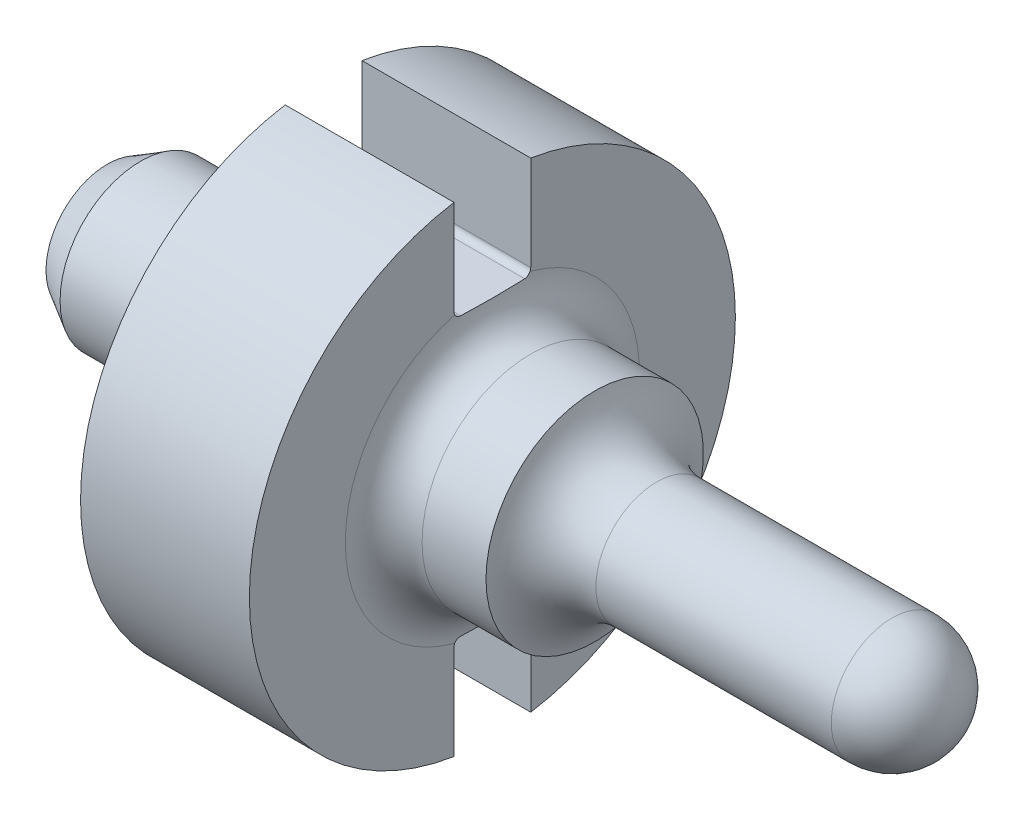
ISO-10303-21;
HEADER;
FILE_DESCRIPTION(('STEP AP214'),'2;1');
FILE_NAME('part.step','',(''),(''),'','','');
FILE_SCHEMA(('AUTOMOTIVE_DESIGN { 1 0 10303 214 1 1 1 1 }'));
ENDSEC;
DATA;
#1=APPLICATION_CONTEXT('core data for automotive mechanical design processes');
#2=APPLICATION_PROTOCOL_DEFINITION('international standard','automotive_design',2000,#1);
#3=PRODUCT_CONTEXT('',#1,'mechanical');
#4=PRODUCT('Part','Part','',(#3));
#5=PRODUCT_RELATED_PRODUCT_CATEGORY('part','',(#4));
#6=PRODUCT_DEFINITION_FORMATION('','',#4);
#7=PRODUCT_DEFINITION_CONTEXT('part definition',#1,'design');
#8=PRODUCT_DEFINITION('design','',#6,#7);
#9=PRODUCT_DEFINITION_SHAPE('','',#8);
#10=(LENGTH_UNIT() NAMED_UNIT(*) SI_UNIT(.MILLI.,.METRE.));
#11=(NAMED_UNIT(*) PLANE_ANGLE_UNIT() SI_UNIT($,.RADIAN.));
#12=(NAMED_UNIT(*) SI_UNIT($,.STERADIAN.) SOLID_ANGLE_UNIT());
#13=UNCERTAINTY_MEASURE_WITH_UNIT(LENGTH_MEASURE(1.E-05),#10,'distance_accuracy_value','');
#14=(GEOMETRIC_REPRESENTATION_CONTEXT(3) GLOBAL_UNCERTAINTY_ASSIGNED_CONTEXT((#13)) GLOBAL_UNIT_ASSIGNED_CONTEXT((#10,
#11,#12)) REPRESENTATION_CONTEXT('',''));
#15=CARTESIAN_POINT('',(0.,0.,0.));
#16=DIRECTION('',(0.,0.,1.));
#17=DIRECTION('',(1.,0.,0.));
#18=AXIS2_PLACEMENT_3D('',#15,#16,#17);
#19=CARTESIAN_POINT('',(0.,0.,0.));
#20=DIRECTION('',(-1.,0.,0.));
#21=DIRECTION('',(0.,0.,1.));
#22=AXIS2_PLACEMENT_3D('',#19,#20,#21);
#23=CYLINDRICAL_SURFACE('',#22,4.826);
#24=CARTESIAN_POINT('',(7.6454,0.,0.));
#25=DIRECTION('',(-1.,0.,0.));
#26=DIRECTION('',(0.,0.,1.));
#27=AXIS2_PLACEMENT_3D('',#24,#25,#26);
#28=CIRCLE('',#27,4.826);
#29=CARTESIAN_POINT('',(7.6454,-4.7654624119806,0.762));
#30=VERTEX_POINT('',#29);
#31=CARTESIAN_POINT('',(7.6454,4.7654624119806,0.762));
#32=VERTEX_POINT('',#31);
#33=EDGE_CURVE('E153',#30,#32,#28,.T.);
#34=ORIENTED_EDGE('',*,*,#33,.T.);
#35=DIRECTION('',(-1.,0.,0.));
#36=VECTOR('',#35,1.);
#37=CARTESIAN_POINT('',(0.,4.7654624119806,0.762));
#38=LINE('',#37,#36);
#39=CARTESIAN_POINT('',(4.2926,4.7654624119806,0.762));
#40=VERTEX_POINT('',#39);
#41=EDGE_CURVE('E136',#40,#32,#38,.F.);
#42=ORIENTED_EDGE('',*,*,#41,.F.);
#43=CARTESIAN_POINT('',(4.2926,0.,0.));
#44=DIRECTION('',(-1.,0.,0.));
#45=DIRECTION('',(0.,0.,1.));
#46=AXIS2_PLACEMENT_3D('',#43,#44,#45);
#47=CIRCLE('',#46,4.826);
#48=CARTESIAN_POINT('',(4.2926,-4.7654624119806,0.762));
#49=VERTEX_POINT('',#48);
#50=EDGE_CURVE('E151',#49,#40,#47,.T.);
#51=ORIENTED_EDGE('',*,*,#50,.F.);
#52=DIRECTION('',(-1.,0.,0.));
#53=VECTOR('',#52,1.);
#54=CARTESIAN_POINT('',(0.,-4.7654624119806,0.762));
#55=LINE('',#54,#53);
#56=EDGE_CURVE('E304',#30,#49,#55,.T.);
#57=ORIENTED_EDGE('',*,*,#56,.F.);
#58=EDGE_LOOP('',(#34,#42,#51,#57));
#59=FACE_BOUND('',#58,.T.);
#60=ADVANCED_FACE('F33',(#59),#23,.T.);
#61=CARTESIAN_POINT('',(7.6454,4.826,0.));
#62=DIRECTION('',(-1.,0.,0.));
#63=DIRECTION('',(0.,0.,1.));
#64=AXIS2_PLACEMENT_3D('',#61,#62,#63);
#65=PLANE('',#64);
#66=CARTESIAN_POINT('',(7.6454,2.8829,0.635));
#67=DIRECTION('',(-1.,0.,0.));
#68=DIRECTION('',(0.,0.,1.));
#69=AXIS2_PLACEMENT_3D('',#66,#67,#68);
#70=CIRCLE('',#69,0.127);
#71=CARTESIAN_POINT('',(7.6454,2.8829,0.762));
#72=VERTEX_POINT('',#71);
#73=CARTESIAN_POINT('',(7.6454,2.82376450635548,0.747392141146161));
#74=VERTEX_POINT('',#73);
#75=EDGE_CURVE('E380',#72,#74,#70,.F.);
#76=ORIENTED_EDGE('',*,*,#75,.F.);
#77=DIRECTION('',(0.,-1.,0.));
#78=VECTOR('',#77,1.);
#79=CARTESIAN_POINT('',(7.6454,2.8829,0.762));
#80=LINE('',#79,#78);
#81=EDGE_CURVE('E352',#32,#72,#80,.T.);
#82=ORIENTED_EDGE('',*,*,#81,.F.);
#83=ORIENTED_EDGE('',*,*,#33,.F.);
#84=DIRECTION('',(0.,-1.,0.));
#85=VECTOR('',#84,1.);
#86=CARTESIAN_POINT('',(7.6454,-2.8829,0.762));
#87=LINE('',#86,#85);
#88=CARTESIAN_POINT('',(7.6454,-2.8829,0.762));
#89=VERTEX_POINT('',#88);
#90=EDGE_CURVE('E257',#89,#30,#87,.T.);
#91=ORIENTED_EDGE('',*,*,#90,.F.);
#92=CARTESIAN_POINT('',(7.6454,-2.8829,0.635));
#93=DIRECTION('',(-1.,0.,0.));
#94=DIRECTION('',(0.,0.,1.));
#95=AXIS2_PLACEMENT_3D('',#92,#93,#94);
#96=CIRCLE('',#95,0.127);
#97=CARTESIAN_POINT('',(7.6454,-2.82376450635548,0.747392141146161));
#98=VERTEX_POINT('',#97);
#99=EDGE_CURVE('E302',#98,#89,#96,.F.);
#100=ORIENTED_EDGE('',*,*,#99,.F.);
#101=CARTESIAN_POINT('',(7.6454,0.,0.));
#102=DIRECTION('',(-1.,0.,0.));
#103=DIRECTION('',(0.,0.,1.));
#104=AXIS2_PLACEMENT_3D('',#101,#102,#103);
#105=CIRCLE('',#104,2.92100000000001);
#106=EDGE_CURVE('E317',#98,#74,#105,.T.);
#107=ORIENTED_EDGE('',*,*,#106,.T.);
#108=EDGE_LOOP('',(#76,#82,#83,#91,#100,#107));
#109=FACE_BOUND('',#108,.T.);
#110=ADVANCED_FACE('F203',(#109),#65,.F.);
#111=CARTESIAN_POINT('',(0.,0.,0.));
#112=DIRECTION('',(1.,0.,0.));
#113=DIRECTION('',(0.,0.,-1.));
#114=AXIS2_PLACEMENT_3D('',#111,#112,#113);
#115=PLANE('',#114);
#116=CARTESIAN_POINT('',(0.,0.,0.));
#117=DIRECTION('',(-1.,0.,0.));
#118=DIRECTION('',(0.,0.,1.));
#119=AXIS2_PLACEMENT_3D('',#116,#117,#118);
#120=CIRCLE('',#119,1.2192);
#121=CARTESIAN_POINT('',(0.,0.,1.2192));
#122=VERTEX_POINT('',#121);
#123=EDGE_CURVE('E11',#122,#122,#120,.T.);
#124=ORIENTED_EDGE('',*,*,#123,.T.);
#125=EDGE_LOOP('',(#124));
#126=FACE_BOUND('',#125,.T.);
#127=ADVANCED_FACE('F35',(#126),#115,.F.);
#128=CARTESIAN_POINT('',(0.659911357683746,0.,0.));
#129=DIRECTION('',(1.,0.,0.));
#130=DIRECTION('',(0.,0.,-1.));
#131=AXIS2_PLACEMENT_3D('',#128,#129,#130);
#132=CONICAL_SURFACE('',#131,1.6002,0.523598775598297);
#133=ORIENTED_EDGE('',*,*,#123,.F.);
#134=EDGE_LOOP('',(#133));
#135=FACE_BOUND('',#134,.T.);
#136=CARTESIAN_POINT('',(0.659911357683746,0.,0.));
#137=DIRECTION('',(-1.,0.,0.));
#138=DIRECTION('',(0.,0.,1.));
#139=AXIS2_PLACEMENT_3D('',#136,#137,#138);
#140=CIRCLE('',#139,1.6002);
#141=CARTESIAN_POINT('',(0.659911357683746,0.,1.6002));
#142=VERTEX_POINT('',#141);
#143=EDGE_CURVE('E41',#142,#142,#140,.T.);
#144=ORIENTED_EDGE('',*,*,#143,.T.);
#145=EDGE_LOOP('',(#144));
#146=FACE_BOUND('',#145,.T.);
#147=ADVANCED_FACE('F178',(#135,#146),#132,.T.);
#148=CARTESIAN_POINT('',(0.,0.,0.));
#149=DIRECTION('',(-1.,0.,0.));
#150=DIRECTION('',(0.,0.,1.));
#151=AXIS2_PLACEMENT_3D('',#148,#149,#150);
#152=CYLINDRICAL_SURFACE('',#151,1.6002);
#153=ORIENTED_EDGE('',*,*,#143,.F.);
#154=EDGE_LOOP('',(#153));
#155=FACE_BOUND('',#154,.T.);
#156=CARTESIAN_POINT('',(3.5306,0.,0.));
#157=DIRECTION('',(-1.,0.,0.));
#158=DIRECTION('',(0.,0.,1.));
#159=AXIS2_PLACEMENT_3D('',#156,#157,#158);
#160=CIRCLE('',#159,1.6002);
#161=CARTESIAN_POINT('',(3.5306,0.,1.6002));
#162=VERTEX_POINT('',#161);
#163=EDGE_CURVE('E173',#162,#162,#160,.T.);
#164=ORIENTED_EDGE('',*,*,#163,.T.);
#165=EDGE_LOOP('',(#164));
#166=FACE_BOUND('',#165,.T.);
#167=ADVANCED_FACE('F180',(#155,#166),#152,.T.);
#168=CARTESIAN_POINT('',(3.5306,0.,0.));
#169=DIRECTION('',(-1.,0.,0.));
#170=DIRECTION('',(0.,0.,1.));
#171=AXIS2_PLACEMENT_3D('',#168,#169,#170);
#172=TOROIDAL_SURFACE('',#171,2.3622,0.762);
#173=ORIENTED_EDGE('',*,*,#163,.F.);
#174=EDGE_LOOP('',(#173));
#175=FACE_BOUND('',#174,.T.);
#176=CARTESIAN_POINT('',(4.2926,0.,0.));
#177=DIRECTION('',(-1.,0.,0.));
#178=DIRECTION('',(0.,0.,1.));
#179=AXIS2_PLACEMENT_3D('',#176,#177,#178);
#180=CIRCLE('',#179,2.3622);
#181=CARTESIAN_POINT('',(4.2926,0.,2.3622));
#182=VERTEX_POINT('',#181);
#183=EDGE_CURVE('E166',#182,#182,#180,.T.);
#184=ORIENTED_EDGE('',*,*,#183,.T.);
#185=EDGE_LOOP('',(#184));
#186=FACE_BOUND('',#185,.T.);
#187=ADVANCED_FACE('F183',(#175,#186),#172,.F.);
#188=CARTESIAN_POINT('',(4.2926,2.36220000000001,0.));
#189=DIRECTION('',(1.,0.,0.));
#190=DIRECTION('',(0.,0.,-1.));
#191=AXIS2_PLACEMENT_3D('',#188,#189,#190);
#192=PLANE('',#191);
#193=ORIENTED_EDGE('',*,*,#183,.F.);
#194=EDGE_LOOP('',(#193));
#195=FACE_BOUND('',#194,.T.);
#196=ORIENTED_EDGE('',*,*,#50,.T.);
#197=DIRECTION('',(0.,1.,0.));
#198=VECTOR('',#197,1.);
#199=CARTESIAN_POINT('',(4.2926,2.8829,0.762));
#200=LINE('',#199,#198);
#201=CARTESIAN_POINT('',(4.2926,2.8829,0.762));
#202=VERTEX_POINT('',#201);
#203=EDGE_CURVE('E133',#202,#40,#200,.T.);
#204=ORIENTED_EDGE('',*,*,#203,.F.);
#205=CARTESIAN_POINT('',(4.2926,2.8829,0.635));
#206=DIRECTION('',(-1.,0.,0.));
#207=DIRECTION('',(0.,0.,1.));
#208=AXIS2_PLACEMENT_3D('',#205,#206,#207);
#209=CIRCLE('',#208,0.127);
#210=CARTESIAN_POINT('',(4.2926,2.7559,0.634999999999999));
#211=VERTEX_POINT('',#210);
#212=EDGE_CURVE('E546',#211,#202,#209,.T.);
#213=ORIENTED_EDGE('',*,*,#212,.F.);
#214=DIRECTION('',(0.,0.,1.));
#215=VECTOR('',#214,1.);
#216=CARTESIAN_POINT('',(4.2926,2.7559,-0.634999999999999));
#217=LINE('',#216,#215);
#218=CARTESIAN_POINT('',(4.2926,2.7559,-0.634999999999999));
#219=VERTEX_POINT('',#218);
#220=EDGE_CURVE('E542',#219,#211,#217,.T.);
#221=ORIENTED_EDGE('',*,*,#220,.F.);
#222=CARTESIAN_POINT('',(4.2926,2.8829,-0.635));
#223=DIRECTION('',(-1.,0.,0.));
#224=DIRECTION('',(0.,0.,-1.));
#225=AXIS2_PLACEMENT_3D('',#222,#223,#224);
#226=CIRCLE('',#225,0.127);
#227=CARTESIAN_POINT('',(4.2926,2.8829,-0.762));
#228=VERTEX_POINT('',#227);
#229=EDGE_CURVE('E390',#228,#219,#226,.T.);
#230=ORIENTED_EDGE('',*,*,#229,.F.);
#231=DIRECTION('',(0.,-1.,0.));
#232=VECTOR('',#231,1.);
#233=CARTESIAN_POINT('',(4.2926,2.8829,-0.762));
#234=LINE('',#233,#232);
#235=CARTESIAN_POINT('',(4.2926,4.7654624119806,-0.762));
#236=VERTEX_POINT('',#235);
#237=EDGE_CURVE('E144',#236,#228,#234,.T.);
#238=ORIENTED_EDGE('',*,*,#237,.F.);
#239=CARTESIAN_POINT('',(4.2926,-4.7654624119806,-0.762));
#240=VERTEX_POINT('',#239);
#241=EDGE_CURVE('E162',#236,#240,#47,.T.);
#242=ORIENTED_EDGE('',*,*,#241,.T.);
#243=DIRECTION('',(0.,-1.,0.));
#244=VECTOR('',#243,1.);
#245=CARTESIAN_POINT('',(4.2926,-2.8829,-0.762));
#246=LINE('',#245,#244);
#247=CARTESIAN_POINT('',(4.2926,-2.8829,-0.762));
#248=VERTEX_POINT('',#247);
#249=EDGE_CURVE('E283',#248,#240,#246,.T.);
#250=ORIENTED_EDGE('',*,*,#249,.F.);
#251=CARTESIAN_POINT('',(4.2926,-2.8829,-0.635));
#252=DIRECTION('',(-1.,0.,0.));
#253=DIRECTION('',(0.,0.,1.));
#254=AXIS2_PLACEMENT_3D('',#251,#252,#253);
#255=CIRCLE('',#254,0.127);
#256=CARTESIAN_POINT('',(4.2926,-2.7559,-0.634999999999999));
#257=VERTEX_POINT('',#256);
#258=EDGE_CURVE('E291',#257,#248,#255,.T.);
#259=ORIENTED_EDGE('',*,*,#258,.F.);
#260=DIRECTION('',(0.,0.,-1.));
#261=VECTOR('',#260,1.);
#262=CARTESIAN_POINT('',(4.2926,-2.7559,-0.634999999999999));
#263=LINE('',#262,#261);
#264=CARTESIAN_POINT('',(4.2926,-2.7559,0.634999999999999));
#265=VERTEX_POINT('',#264);
#266=EDGE_CURVE('E288',#265,#257,#263,.T.);
#267=ORIENTED_EDGE('',*,*,#266,.F.);
#268=CARTESIAN_POINT('',(4.2926,-2.8829,0.635));
#269=DIRECTION('',(-1.,0.,0.));
#270=DIRECTION('',(0.,0.,-1.));
#271=AXIS2_PLACEMENT_3D('',#268,#269,#270);
#272=CIRCLE('',#271,0.127);
#273=CARTESIAN_POINT('',(4.2926,-2.8829,0.762));
#274=VERTEX_POINT('',#273);
#275=EDGE_CURVE('E286',#274,#265,#272,.T.);
#276=ORIENTED_EDGE('',*,*,#275,.F.);
#277=DIRECTION('',(0.,1.,0.));
#278=VECTOR('',#277,1.);
#279=CARTESIAN_POINT('',(4.2926,-2.8829,0.762));
#280=LINE('',#279,#278);
#281=EDGE_CURVE('E161',#49,#274,#280,.T.);
#282=ORIENTED_EDGE('',*,*,#281,.F.);
#283=EDGE_LOOP('',(#196,#204,#213,#221,#230,#238,#242,#250,#259,#267,#276,#282));
#284=FACE_BOUND('',#283,.T.);
#285=ADVANCED_FACE('F158',(#195,#284),#192,.F.);
#286=ORIENTED_EDGE('',*,*,#241,.F.);
#287=DIRECTION('',(-1.,0.,0.));
#288=VECTOR('',#287,1.);
#289=CARTESIAN_POINT('',(0.,4.7654624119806,-0.762));
#290=LINE('',#289,#288);
#291=CARTESIAN_POINT('',(7.6454,4.7654624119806,-0.762));
#292=VERTEX_POINT('',#291);
#293=EDGE_CURVE('E155',#292,#236,#290,.T.);
#294=ORIENTED_EDGE('',*,*,#293,.F.);
#295=CARTESIAN_POINT('',(7.6454,-4.7654624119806,-0.762));
#296=VERTEX_POINT('',#295);
#297=EDGE_CURVE('E163',#292,#296,#28,.T.);
#298=ORIENTED_EDGE('',*,*,#297,.T.);
#299=DIRECTION('',(-1.,0.,0.));
#300=VECTOR('',#299,1.);
#301=CARTESIAN_POINT('',(0.,-4.7654624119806,-0.762));
#302=LINE('',#301,#300);
#303=EDGE_CURVE('E320',#240,#296,#302,.F.);
#304=ORIENTED_EDGE('',*,*,#303,.F.);
#305=EDGE_LOOP('',(#286,#294,#298,#304));
#306=FACE_BOUND('',#305,.T.);
#307=ADVANCED_FACE('F193',(#306),#23,.T.);
#308=DIRECTION('',(0.,1.,0.));
#309=VECTOR('',#308,1.);
#310=CARTESIAN_POINT('',(7.6454,2.8829,-0.762));
#311=LINE('',#310,#309);
#312=CARTESIAN_POINT('',(7.6454,2.8829,-0.762));
#313=VERTEX_POINT('',#312);
#314=EDGE_CURVE('E333',#313,#292,#311,.T.);
#315=ORIENTED_EDGE('',*,*,#314,.F.);
#316=CARTESIAN_POINT('',(7.6454,2.8829,-0.635));
#317=DIRECTION('',(-1.,0.,0.));
#318=DIRECTION('',(0.,0.,1.));
#319=AXIS2_PLACEMENT_3D('',#316,#317,#318);
#320=CIRCLE('',#319,0.127);
#321=CARTESIAN_POINT('',(7.6454,2.82376450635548,-0.747392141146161));
#322=VERTEX_POINT('',#321);
#323=EDGE_CURVE('E154',#322,#313,#320,.F.);
#324=ORIENTED_EDGE('',*,*,#323,.F.);
#325=CARTESIAN_POINT('',(7.6454,-2.82376450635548,-0.747392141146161));
#326=VERTEX_POINT('',#325);
#327=EDGE_CURVE('E374',#322,#326,#105,.T.);
#328=ORIENTED_EDGE('',*,*,#327,.T.);
#329=CARTESIAN_POINT('',(7.6454,-2.8829,-0.635));
#330=DIRECTION('',(-1.,0.,0.));
#331=DIRECTION('',(0.,0.,1.));
#332=AXIS2_PLACEMENT_3D('',#329,#330,#331);
#333=CIRCLE('',#332,0.127);
#334=CARTESIAN_POINT('',(7.6454,-2.8829,-0.762));
#335=VERTEX_POINT('',#334);
#336=EDGE_CURVE('E319',#335,#326,#333,.F.);
#337=ORIENTED_EDGE('',*,*,#336,.F.);
#338=DIRECTION('',(0.,1.,0.));
#339=VECTOR('',#338,1.);
#340=CARTESIAN_POINT('',(7.6454,-2.8829,-0.762));
#341=LINE('',#340,#339);
#342=EDGE_CURVE('E276',#296,#335,#341,.T.);
#343=ORIENTED_EDGE('',*,*,#342,.F.);
#344=ORIENTED_EDGE('',*,*,#297,.F.);
#345=EDGE_LOOP('',(#315,#324,#328,#337,#343,#344));
#346=FACE_BOUND('',#345,.T.);
#347=ADVANCED_FACE('F199',(#346),#65,.F.);
#348=CARTESIAN_POINT('',(8.4074,0.,0.));
#349=DIRECTION('',(-1.,0.,0.));
#350=DIRECTION('',(0.,0.,1.));
#351=AXIS2_PLACEMENT_3D('',#348,#349,#350);
#352=TOROIDAL_SURFACE('',#351,2.921,0.762);
#353=CARTESIAN_POINT('',(7.88389361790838,2.7559,2.11626178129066));
#354=CARTESIAN_POINT('',(7.86619216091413,2.7559,2.0887675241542));
#355=CARTESIAN_POINT('',(7.84985482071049,2.7559,2.06044551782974));
#356=CARTESIAN_POINT('',(7.81969906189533,2.7559,2.00256133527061));
#357=CARTESIAN_POINT('',(7.80587537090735,2.7559,1.97300191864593));
#358=CARTESIAN_POINT('',(7.76826995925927,2.7559,1.88411437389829));
#359=CARTESIAN_POINT('',(7.74766498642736,2.7559,1.82344461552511));
#360=CARTESIAN_POINT('',(7.70905721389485,2.7559,1.68482654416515));
#361=CARTESIAN_POINT('',(7.69300311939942,2.7559,1.60636095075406));
#362=CARTESIAN_POINT('',(7.66875230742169,2.7559,1.44819238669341));
#363=CARTESIAN_POINT('',(7.66056876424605,2.7559,1.36848756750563));
#364=CARTESIAN_POINT('',(7.64957261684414,2.7559,1.2074566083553));
#365=CARTESIAN_POINT('',(7.64684940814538,2.7559,1.12612516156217));
#366=CARTESIAN_POINT('',(7.64485892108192,2.7559,0.963487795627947));
#367=CARTESIAN_POINT('',(7.64559002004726,2.7559,0.882181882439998));
#368=CARTESIAN_POINT('',(7.64855422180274,2.7559,0.72410165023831));
#369=CARTESIAN_POINT('',(7.65070210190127,2.7559,0.647325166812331));
#370=CARTESIAN_POINT('',(7.655101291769,2.7559,0.493772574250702));
#371=CARTESIAN_POINT('',(7.65735260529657,2.7559,0.416996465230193));
#372=CARTESIAN_POINT('',(7.66097646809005,2.7559,0.263438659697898));
#373=CARTESIAN_POINT('',(7.66234922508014,2.7559,0.186656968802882));
#374=CARTESIAN_POINT('',(7.66368739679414,2.7559,0.0330855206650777));
#375=CARTESIAN_POINT('',(7.66365291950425,2.7559,-0.0437042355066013));
#376=CARTESIAN_POINT('',(7.66219235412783,2.7559,-0.197017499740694));
#377=CARTESIAN_POINT('',(7.66077081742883,2.7559,-0.273541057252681));
#378=CARTESIAN_POINT('',(7.65708902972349,2.7559,-0.426576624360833));
#379=CARTESIAN_POINT('',(7.6548286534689,2.7559,-0.503088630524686));
#380=CARTESIAN_POINT('',(7.65045647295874,2.7559,-0.656116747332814));
#381=CARTESIAN_POINT('',(7.64834466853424,2.7559,-0.732632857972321));
#382=CARTESIAN_POINT('',(7.64557952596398,2.7559,-0.885686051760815));
#383=CARTESIAN_POINT('',(7.64492586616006,2.7559,-0.962223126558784));
#384=CARTESIAN_POINT('',(7.6464173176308,2.7559,-1.09535113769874));
#385=CARTESIAN_POINT('',(7.64787803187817,2.7559,-1.15194685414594));
#386=CARTESIAN_POINT('',(7.65317151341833,2.7559,-1.26504173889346));
#387=CARTESIAN_POINT('',(7.65700449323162,2.7559,-1.32154089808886));
#388=CARTESIAN_POINT('',(7.66779460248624,2.7559,-1.43376621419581));
#389=CARTESIAN_POINT('',(7.67472434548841,2.7559,-1.48949482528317));
#390=CARTESIAN_POINT('',(7.69257045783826,2.7559,-1.60030286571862));
#391=CARTESIAN_POINT('',(7.7034859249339,2.7559,-1.65538243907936));
#392=CARTESIAN_POINT('',(7.73430041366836,2.7559,-1.7806290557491));
#393=CARTESIAN_POINT('',(7.75590556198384,2.7559,-1.8504125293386));
#394=CARTESIAN_POINT('',(7.79667767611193,2.7559,-1.95247821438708));
#395=CARTESIAN_POINT('',(7.8118379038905,2.7559,-1.98635784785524));
#396=CARTESIAN_POINT('',(7.84536755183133,2.7559,-2.05260107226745));
#397=CARTESIAN_POINT('',(7.8637459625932,2.7559,-2.08496008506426));
#398=CARTESIAN_POINT('',(7.88389361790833,2.7559,-2.11626178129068));
#399=B_SPLINE_CURVE_WITH_KNOTS('',3,(#353,#354,#355,#356,#357,#358,#359,#360,#361,#362,#363,
#364,#365,#366,#367,#368,#369,#370,#371,#372,#373,#374,#375,#376,#377,#378,#379,#380,#381,#382,
#383,#384,#385,#386,#387,#388,#389,#390,#391,#392,#393,#394,#395,#396,#397,#398),.UNSPECIFIED.,
.F.,.F.,(4,2,2,2,2,2,2,2,2,2,2,2,2,2,2,2,2,2,2,2,2,2,4),(0.,0.0979959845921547,
0.195783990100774,0.387428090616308,0.627136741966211,0.867245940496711,1.11125507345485,
1.35514959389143,1.58556813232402,1.81599504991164,2.04636746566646,2.27672220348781,
2.50632360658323,2.73595930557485,2.96559474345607,3.19517952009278,3.3649878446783,
3.5348113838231,3.70316191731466,3.8714743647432,4.08983315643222,4.20103251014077,
4.3125476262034),.UNSPECIFIED.);
#400=CARTESIAN_POINT('',(7.6510828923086,2.7559,0.634999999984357));
#401=VERTEX_POINT('',#400);
#402=CARTESIAN_POINT('',(7.65108289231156,2.75589999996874,-0.635000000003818));
#403=VERTEX_POINT('',#402);
#404=EDGE_CURVE('E346',#401,#403,#399,.T.);
#405=ORIENTED_EDGE('',*,*,#404,.F.);
#406=CARTESIAN_POINT('',(7.64785341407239,2.8831,0.761999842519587));
#407=CARTESIAN_POINT('',(7.64730191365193,2.87605276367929,0.762017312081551));
#408=CARTESIAN_POINT('',(7.64683725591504,2.86899858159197,0.761435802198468));
#409=CARTESIAN_POINT('',(7.64609536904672,2.85507948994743,0.75911415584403));
#410=CARTESIAN_POINT('',(7.64581798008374,2.84821442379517,0.757375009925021));
#411=CARTESIAN_POINT('',(7.64546326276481,2.8348593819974,0.752775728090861));
#412=CARTESIAN_POINT('',(7.64538607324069,2.82836966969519,0.749914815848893));
#413=CARTESIAN_POINT('',(7.64541802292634,2.81595778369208,0.743155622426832));
#414=CARTESIAN_POINT('',(7.64552712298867,2.81003549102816,0.739257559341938));
#415=CARTESIAN_POINT('',(7.64589822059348,2.79893152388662,0.73054087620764));
#416=CARTESIAN_POINT('',(7.64616000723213,2.79374884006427,0.725723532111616));
#417=CARTESIAN_POINT('',(7.64678690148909,2.78425521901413,0.715298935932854));
#418=CARTESIAN_POINT('',(7.64715203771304,2.77994452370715,0.709691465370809));
#419=CARTESIAN_POINT('',(7.64792985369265,2.77227532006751,0.697784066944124));
#420=CARTESIAN_POINT('',(7.64834296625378,2.76892660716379,0.691477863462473));
#421=CARTESIAN_POINT('',(7.64914917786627,2.76333211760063,0.678394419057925));
#422=CARTESIAN_POINT('',(7.6495422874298,2.76108575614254,0.67161743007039));
#423=CARTESIAN_POINT('',(7.65014519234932,2.75824522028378,0.65980996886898));
#424=CARTESIAN_POINT('',(7.6503749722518,2.75735995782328,0.65484854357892));
#425=CARTESIAN_POINT('',(7.65077799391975,2.75618330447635,0.644859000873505));
#426=CARTESIAN_POINT('',(7.65095129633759,2.75589127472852,0.639830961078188));
#427=CARTESIAN_POINT('',(7.65108838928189,2.75590015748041,0.634799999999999));
#428=B_SPLINE_CURVE_WITH_KNOTS('',3,(#406,#407,#408,#409,#410,#411,#412,#413,#414,#415,#416,
#417,#418,#419,#420,#421,#422,#423,#424,#425,#426,#427),.UNSPECIFIED.,.F.,.F.,(4,2,2,2,2,2,2,2,
2,2,4),(0.,0.0211799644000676,0.04234182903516,0.0635183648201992,0.0846904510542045,
0.105833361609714,0.12698212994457,0.148339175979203,0.169684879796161,0.184786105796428,
0.199871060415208),.UNSPECIFIED.);
#429=EDGE_CURVE('E145',#74,#401,#428,.T.);
#430=ORIENTED_EDGE('',*,*,#429,.F.);
#431=ORIENTED_EDGE('',*,*,#106,.F.);
#432=CARTESIAN_POINT('',(7.65108838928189,-2.75590015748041,0.634799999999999));
#433=CARTESIAN_POINT('',(7.65089549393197,-2.75588303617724,0.641946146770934));
#434=CARTESIAN_POINT('',(7.65062664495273,-2.75648044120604,0.649088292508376));
#435=CARTESIAN_POINT('',(7.64999019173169,-2.7588581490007,0.663161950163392));
#436=CARTESIAN_POINT('',(7.64962267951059,-2.76063735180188,0.67009365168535));
#437=CARTESIAN_POINT('',(7.64884138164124,-2.76533332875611,0.683559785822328));
#438=CARTESIAN_POINT('',(7.64842758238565,-2.76825043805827,0.690094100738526));
#439=CARTESIAN_POINT('',(7.64761869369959,-2.7751386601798,0.702581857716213));
#440=CARTESIAN_POINT('',(7.64722360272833,-2.7791096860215,0.708535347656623));
#441=CARTESIAN_POINT('',(7.64651480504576,-2.7880092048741,0.719710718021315));
#442=CARTESIAN_POINT('',(7.64620132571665,-2.79294030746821,0.724930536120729));
#443=CARTESIAN_POINT('',(7.64571388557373,-2.80361523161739,0.734469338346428));
#444=CARTESIAN_POINT('',(7.64553993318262,-2.80935910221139,0.73878826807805));
#445=CARTESIAN_POINT('',(7.64537389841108,-2.82144767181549,0.746369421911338));
#446=CARTESIAN_POINT('',(7.64538045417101,-2.82778751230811,0.749639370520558));
#447=CARTESIAN_POINT('',(7.64559335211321,-2.84092101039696,0.755071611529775));
#448=CARTESIAN_POINT('',(7.64579959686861,-2.84771444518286,0.757234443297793));
#449=CARTESIAN_POINT('',(7.64631085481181,-2.85930554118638,0.759881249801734));
#450=CARTESIAN_POINT('',(7.64656213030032,-2.86403579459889,0.760682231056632));
#451=CARTESIAN_POINT('',(7.64714749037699,-2.87354458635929,0.761745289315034));
#452=CARTESIAN_POINT('',(7.64748145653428,-2.87832304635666,0.762008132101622));
#453=CARTESIAN_POINT('',(7.64785341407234,-2.88309999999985,0.761999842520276));
#454=B_SPLINE_CURVE_WITH_KNOTS('',3,(#432,#433,#434,#435,#436,#437,#438,#439,#440,#441,#442,
#443,#444,#445,#446,#447,#448,#449,#450,#451,#452,#453),.UNSPECIFIED.,.F.,.F.,(4,2,2,2,2,2,2,2,
2,2,4),(0.,0.0214158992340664,0.0428118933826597,0.0642141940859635,0.0856147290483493,
0.107074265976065,0.128535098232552,0.149834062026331,0.171122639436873,0.185505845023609,
0.1998685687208),.UNSPECIFIED.);
#455=CARTESIAN_POINT('',(7.65108289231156,-2.75589999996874,0.635000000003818));
#456=VERTEX_POINT('',#455);
#457=EDGE_CURVE('E249',#456,#98,#454,.T.);
#458=ORIENTED_EDGE('',*,*,#457,.F.);
#459=CARTESIAN_POINT('',(7.88389361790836,-2.7559,-2.11626178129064));
#460=CARTESIAN_POINT('',(7.86619216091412,-2.7559,-2.08876752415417));
#461=CARTESIAN_POINT('',(7.84985482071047,-2.7559,-2.06044551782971));
#462=CARTESIAN_POINT('',(7.81969906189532,-2.7559,-2.00256133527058));
#463=CARTESIAN_POINT('',(7.80587537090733,-2.7559,-1.97300191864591));
#464=CARTESIAN_POINT('',(7.76826995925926,-2.7559,-1.88411437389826));
#465=CARTESIAN_POINT('',(7.74766498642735,-2.7559,-1.82344461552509));
#466=CARTESIAN_POINT('',(7.70905721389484,-2.7559,-1.68482654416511));
#467=CARTESIAN_POINT('',(7.69300311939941,-2.7559,-1.60636095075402));
#468=CARTESIAN_POINT('',(7.66875230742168,-2.7559,-1.44819238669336));
#469=CARTESIAN_POINT('',(7.66056876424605,-2.7559,-1.36848756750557));
#470=CARTESIAN_POINT('',(7.64957261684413,-2.7559,-1.20745660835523));
#471=CARTESIAN_POINT('',(7.64684940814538,-2.7559,-1.1261251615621));
#472=CARTESIAN_POINT('',(7.64485892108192,-2.7559,-0.963487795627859));
#473=CARTESIAN_POINT('',(7.64559002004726,-2.7559,-0.882181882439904));
#474=CARTESIAN_POINT('',(7.64855422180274,-2.7559,-0.724101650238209));
#475=CARTESIAN_POINT('',(7.65070210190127,-2.7559,-0.647325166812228));
#476=CARTESIAN_POINT('',(7.655101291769,-2.7559,-0.493772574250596));
#477=CARTESIAN_POINT('',(7.65735260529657,-2.7559,-0.416996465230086));
#478=CARTESIAN_POINT('',(7.66097646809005,-2.7559,-0.263438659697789));
#479=CARTESIAN_POINT('',(7.66234922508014,-2.7559,-0.186656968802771));
#480=CARTESIAN_POINT('',(7.66368739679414,-2.7559,-0.033085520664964));
#481=CARTESIAN_POINT('',(7.66365291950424,-2.7559,0.0437042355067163));
#482=CARTESIAN_POINT('',(7.66219235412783,-2.7559,0.197017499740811));
#483=CARTESIAN_POINT('',(7.66077081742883,-2.7559,0.2735410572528));
#484=CARTESIAN_POINT('',(7.65708902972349,-2.7559,0.426576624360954));
#485=CARTESIAN_POINT('',(7.65482865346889,-2.7559,0.50308863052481));
#486=CARTESIAN_POINT('',(7.65045647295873,-2.7559,0.65611674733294));
#487=CARTESIAN_POINT('',(7.64834466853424,-2.7559,0.732632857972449));
#488=CARTESIAN_POINT('',(7.64557952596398,-2.7559,0.885686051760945));
#489=CARTESIAN_POINT('',(7.64492586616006,-2.7559,0.962223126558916));
#490=CARTESIAN_POINT('',(7.6464173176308,-2.7559,1.09535113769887));
#491=CARTESIAN_POINT('',(7.64787803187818,-2.7559,1.15194685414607));
#492=CARTESIAN_POINT('',(7.65317151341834,-2.7559,1.26504173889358));
#493=CARTESIAN_POINT('',(7.65700449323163,-2.7559,1.32154089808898));
#494=CARTESIAN_POINT('',(7.66779460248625,-2.7559,1.43376621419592));
#495=CARTESIAN_POINT('',(7.67472434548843,-2.7559,1.48949482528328));
#496=CARTESIAN_POINT('',(7.69257045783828,-2.7559,1.60030286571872));
#497=CARTESIAN_POINT('',(7.70348592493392,-2.7559,1.65538243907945));
#498=CARTESIAN_POINT('',(7.73430041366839,-2.7559,1.78062905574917));
#499=CARTESIAN_POINT('',(7.75590556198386,-2.7559,1.85041252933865));
#500=CARTESIAN_POINT('',(7.79667767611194,-2.7559,1.9524782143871));
#501=CARTESIAN_POINT('',(7.81183790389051,-2.7559,1.98635784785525));
#502=CARTESIAN_POINT('',(7.84536755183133,-2.7559,2.05260107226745));
#503=CARTESIAN_POINT('',(7.86374596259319,-2.7559,2.08496008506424));
#504=CARTESIAN_POINT('',(7.88389361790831,-2.7559,2.11626178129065));
#505=B_SPLINE_CURVE_WITH_KNOTS('',3,(#459,#460,#461,#462,#463,#464,#465,#466,#467,#468,#469,
#470,#471,#472,#473,#474,#475,#476,#477,#478,#479,#480,#481,#482,#483,#484,#485,#486,#487,#488,
#489,#490,#491,#492,#493,#494,#495,#496,#497,#498,#499,#500,#501,#502,#503,#504),.UNSPECIFIED.,
.F.,.F.,(4,2,2,2,2,2,2,2,2,2,2,2,2,2,2,2,2,2,2,2,2,2,4),(0.,0.0979959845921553,
0.195783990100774,0.387428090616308,0.627136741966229,0.867245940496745,1.1112550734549,
1.3551495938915,1.58556813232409,1.81599504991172,2.04636746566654,2.2767222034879,
2.50632360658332,2.73595930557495,2.96559474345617,3.19517952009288,3.36498784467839,
3.53481138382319,3.70316191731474,3.87147436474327,4.08983315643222,4.20103251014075,
4.31254762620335),.UNSPECIFIED.);
#506=CARTESIAN_POINT('',(7.6510828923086,-2.7559,-0.634999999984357));
#507=VERTEX_POINT('',#506);
#508=EDGE_CURVE('E269',#507,#456,#505,.T.);
#509=ORIENTED_EDGE('',*,*,#508,.F.);
#510=CARTESIAN_POINT('',(7.64785341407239,-2.8831,-0.761999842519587));
#511=CARTESIAN_POINT('',(7.64730191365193,-2.87605276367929,-0.762017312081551));
#512=CARTESIAN_POINT('',(7.64683725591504,-2.86899858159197,-0.761435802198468));
#513=CARTESIAN_POINT('',(7.64609536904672,-2.85507948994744,-0.75911415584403));
#514=CARTESIAN_POINT('',(7.64581798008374,-2.84821442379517,-0.757375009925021));
#515=CARTESIAN_POINT('',(7.64546326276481,-2.8348593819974,-0.752775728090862));
#516=CARTESIAN_POINT('',(7.64538607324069,-2.82836966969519,-0.749914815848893));
#517=CARTESIAN_POINT('',(7.64541802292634,-2.81595778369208,-0.743155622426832));
#518=CARTESIAN_POINT('',(7.64552712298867,-2.81003549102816,-0.739257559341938));
#519=CARTESIAN_POINT('',(7.64589822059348,-2.79893152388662,-0.73054087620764));
#520=CARTESIAN_POINT('',(7.64616000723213,-2.79374884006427,-0.725723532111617));
#521=CARTESIAN_POINT('',(7.64678690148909,-2.78425521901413,-0.715298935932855));
#522=CARTESIAN_POINT('',(7.64715203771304,-2.77994452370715,-0.70969146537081));
#523=CARTESIAN_POINT('',(7.64792985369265,-2.77227532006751,-0.697784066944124));
#524=CARTESIAN_POINT('',(7.64834296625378,-2.76892660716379,-0.691477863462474));
#525=CARTESIAN_POINT('',(7.64914917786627,-2.76333211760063,-0.678394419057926));
#526=CARTESIAN_POINT('',(7.6495422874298,-2.76108575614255,-0.67161743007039));
#527=CARTESIAN_POINT('',(7.65014519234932,-2.75824522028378,-0.659809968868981));
#528=CARTESIAN_POINT('',(7.6503749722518,-2.75735995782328,-0.654848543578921));
#529=CARTESIAN_POINT('',(7.65077799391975,-2.75618330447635,-0.644859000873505));
#530=CARTESIAN_POINT('',(7.65095129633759,-2.75589127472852,-0.639830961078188));
#531=CARTESIAN_POINT('',(7.65108838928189,-2.75590015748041,-0.634799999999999));
#532=B_SPLINE_CURVE_WITH_KNOTS('',3,(#510,#511,#512,#513,#514,#515,#516,#517,#518,#519,#520,
#521,#522,#523,#524,#525,#526,#527,#528,#529,#530,#531),.UNSPECIFIED.,.F.,.F.,(4,2,2,2,2,2,2,2,
2,2,4),(0.,0.0211799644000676,0.04234182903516,0.0635183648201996,0.0846904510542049,
0.105833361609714,0.12698212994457,0.148339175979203,0.169684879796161,0.184786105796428,
0.199871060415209),.UNSPECIFIED.);
#533=EDGE_CURVE('E275',#326,#507,#532,.T.);
#534=ORIENTED_EDGE('',*,*,#533,.F.);
#535=ORIENTED_EDGE('',*,*,#327,.F.);
#536=CARTESIAN_POINT('',(7.65108838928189,2.75590015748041,-0.634799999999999));
#537=CARTESIAN_POINT('',(7.65089549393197,2.75588303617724,-0.641946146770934));
#538=CARTESIAN_POINT('',(7.65062664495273,2.75648044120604,-0.649088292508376));
#539=CARTESIAN_POINT('',(7.64999019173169,2.7588581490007,-0.663161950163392));
#540=CARTESIAN_POINT('',(7.64962267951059,2.76063735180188,-0.67009365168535));
#541=CARTESIAN_POINT('',(7.64884138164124,2.76533332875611,-0.683559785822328));
#542=CARTESIAN_POINT('',(7.64842758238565,2.76825043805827,-0.690094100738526));
#543=CARTESIAN_POINT('',(7.64761869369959,2.7751386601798,-0.702581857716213));
#544=CARTESIAN_POINT('',(7.64722360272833,2.7791096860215,-0.708535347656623));
#545=CARTESIAN_POINT('',(7.64651480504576,2.7880092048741,-0.719710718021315));
#546=CARTESIAN_POINT('',(7.64620132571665,2.79294030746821,-0.724930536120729));
#547=CARTESIAN_POINT('',(7.64571388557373,2.80361523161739,-0.734469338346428));
#548=CARTESIAN_POINT('',(7.64553993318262,2.80935910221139,-0.73878826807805));
#549=CARTESIAN_POINT('',(7.64537389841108,2.82144767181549,-0.746369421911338));
#550=CARTESIAN_POINT('',(7.64538045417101,2.82778751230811,-0.749639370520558));
#551=CARTESIAN_POINT('',(7.64559335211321,2.84092101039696,-0.755071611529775));
#552=CARTESIAN_POINT('',(7.64579959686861,2.84771444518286,-0.757234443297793));
#553=CARTESIAN_POINT('',(7.64631085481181,2.85930554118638,-0.759881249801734));
#554=CARTESIAN_POINT('',(7.64656213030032,2.86403579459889,-0.760682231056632));
#555=CARTESIAN_POINT('',(7.64714749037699,2.87354458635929,-0.761745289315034));
#556=CARTESIAN_POINT('',(7.64748145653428,2.87832304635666,-0.762008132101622));
#557=CARTESIAN_POINT('',(7.64785341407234,2.88309999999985,-0.761999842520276));
#558=B_SPLINE_CURVE_WITH_KNOTS('',3,(#536,#537,#538,#539,#540,#541,#542,#543,#544,#545,#546,
#547,#548,#549,#550,#551,#552,#553,#554,#555,#556,#557),.UNSPECIFIED.,.F.,.F.,(4,2,2,2,2,2,2,2,
2,2,4),(0.,0.0214158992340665,0.0428118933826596,0.0642141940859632,0.0856147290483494,
0.107074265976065,0.128535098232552,0.149834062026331,0.171122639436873,0.185505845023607,
0.199868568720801),.UNSPECIFIED.);
#559=EDGE_CURVE('E325',#403,#322,#558,.T.);
#560=ORIENTED_EDGE('',*,*,#559,.F.);
#561=EDGE_LOOP('',(#405,#430,#431,#458,#509,#534,#535,#560));
#562=FACE_BOUND('',#561,.T.);
#563=CARTESIAN_POINT('',(8.40740000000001,0.,0.));
#564=DIRECTION('',(-1.,0.,0.));
#565=DIRECTION('',(0.,0.,1.));
#566=AXIS2_PLACEMENT_3D('',#563,#564,#565);
#567=CIRCLE('',#566,2.159);
#568=CARTESIAN_POINT('',(8.40740000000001,0.,2.159));
#569=VERTEX_POINT('',#568);
#570=EDGE_CURVE('E551',#569,#569,#567,.T.);
#571=ORIENTED_EDGE('',*,*,#570,.T.);
#572=EDGE_LOOP('',(#571));
#573=FACE_BOUND('',#572,.T.);
#574=ADVANCED_FACE('F211',(#562,#573),#352,.F.);
#575=CARTESIAN_POINT('',(0.,0.,0.));
#576=DIRECTION('',(-1.,0.,0.));
#577=DIRECTION('',(0.,0.,1.));
#578=AXIS2_PLACEMENT_3D('',#575,#576,#577);
#579=CYLINDRICAL_SURFACE('',#578,2.159);
#580=ORIENTED_EDGE('',*,*,#570,.F.);
#581=EDGE_LOOP('',(#580));
#582=FACE_BOUND('',#581,.T.);
#583=CARTESIAN_POINT('',(9.6774,0.,0.));
#584=DIRECTION('',(-1.,0.,0.));
#585=DIRECTION('',(0.,0.,1.));
#586=AXIS2_PLACEMENT_3D('',#583,#584,#585);
#587=CIRCLE('',#586,2.159);
#588=CARTESIAN_POINT('',(9.6774,0.,2.159));
#589=VERTEX_POINT('',#588);
#590=EDGE_CURVE('E555',#589,#589,#587,.T.);
#591=ORIENTED_EDGE('',*,*,#590,.T.);
#592=EDGE_LOOP('',(#591));
#593=FACE_BOUND('',#592,.T.);
#594=ADVANCED_FACE('F215',(#582,#593),#579,.T.);
#595=CARTESIAN_POINT('',(10.9070722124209,0.,0.));
#596=DIRECTION('',(-1.,0.,0.));
#597=DIRECTION('',(0.,0.,1.));
#598=AXIS2_PLACEMENT_3D('',#595,#596,#597);
#599=TOROIDAL_SURFACE('',#598,2.4765,1.27);
#600=ORIENTED_EDGE('',*,*,#590,.F.);
#601=EDGE_LOOP('',(#600));
#602=FACE_BOUND('',#601,.T.);
#603=CARTESIAN_POINT('',(10.9070722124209,0.,0.));
#604=DIRECTION('',(-1.,0.,0.));
#605=DIRECTION('',(0.,0.,1.));
#606=AXIS2_PLACEMENT_3D('',#603,#604,#605);
#607=CIRCLE('',#606,1.2065);
#608=CARTESIAN_POINT('',(10.9070722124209,0.,1.2065));
#609=VERTEX_POINT('',#608);
#610=EDGE_CURVE('E557',#609,#609,#607,.T.);
#611=ORIENTED_EDGE('',*,*,#610,.T.);
#612=EDGE_LOOP('',(#611));
#613=FACE_BOUND('',#612,.T.);
#614=ADVANCED_FACE('F219',(#602,#613),#599,.F.);
#615=CARTESIAN_POINT('',(0.,0.,0.));
#616=DIRECTION('',(-1.,0.,0.));
#617=DIRECTION('',(0.,0.,1.));
#618=AXIS2_PLACEMENT_3D('',#615,#616,#617);
#619=CYLINDRICAL_SURFACE('',#618,1.2065);
#620=ORIENTED_EDGE('',*,*,#610,.F.);
#621=EDGE_LOOP('',(#620));
#622=FACE_BOUND('',#621,.T.);
#623=CARTESIAN_POINT('',(15.5829,0.,0.));
#624=DIRECTION('',(-1.,0.,0.));
#625=DIRECTION('',(0.,0.,1.));
#626=AXIS2_PLACEMENT_3D('',#623,#624,#625);
#627=CIRCLE('',#626,1.2065);
#628=CARTESIAN_POINT('',(15.5829,0.,1.2065));
#629=VERTEX_POINT('',#628);
#630=EDGE_CURVE('E259',#629,#629,#627,.T.);
#631=ORIENTED_EDGE('',*,*,#630,.T.);
#632=EDGE_LOOP('',(#631));
#633=FACE_BOUND('',#632,.T.);
#634=ADVANCED_FACE('F223',(#622,#633),#619,.T.);
#635=CARTESIAN_POINT('',(15.5829,0.,0.));
#636=DIRECTION('',(-1.,0.,0.));
#637=DIRECTION('',(0.,1.,0.));
#638=AXIS2_PLACEMENT_3D('',#635,#636,#637);
#639=SPHERICAL_SURFACE('',#638,1.2065);
#640=ORIENTED_EDGE('',*,*,#630,.F.);
#641=EDGE_LOOP('',(#640));
#642=FACE_BOUND('',#641,.T.);
#643=ADVANCED_FACE('F227',(#642),#639,.T.);
#644=CARTESIAN_POINT('',(16.7904,-2.8829,-0.762));
#645=DIRECTION('',(0.,0.,-1.));
#646=DIRECTION('',(0.,1.,0.));
#647=AXIS2_PLACEMENT_3D('',#644,#645,#646);
#648=PLANE('',#647);
#649=ORIENTED_EDGE('',*,*,#303,.T.);
#650=ORIENTED_EDGE('',*,*,#342,.T.);
#651=DIRECTION('',(-1.,0.,0.));
#652=VECTOR('',#651,1.);
#653=CARTESIAN_POINT('',(16.7904,-2.8829,-0.762));
#654=LINE('',#653,#652);
#655=EDGE_CURVE('E295',#335,#248,#654,.T.);
#656=ORIENTED_EDGE('',*,*,#655,.T.);
#657=ORIENTED_EDGE('',*,*,#249,.T.);
#658=EDGE_LOOP('',(#649,#650,#656,#657));
#659=FACE_BOUND('',#658,.T.);
#660=ADVANCED_FACE('F231',(#659),#648,.F.);
#661=CARTESIAN_POINT('',(16.7904,-2.8829,-0.635));
#662=DIRECTION('',(-1.,0.,0.));
#663=DIRECTION('',(0.,0.,1.));
#664=AXIS2_PLACEMENT_3D('',#661,#662,#663);
#665=CYLINDRICAL_SURFACE('',#664,0.127);
#666=ORIENTED_EDGE('',*,*,#336,.T.);
#667=ORIENTED_EDGE('',*,*,#533,.T.);
#668=DIRECTION('',(-1.,0.,0.));
#669=VECTOR('',#668,1.);
#670=CARTESIAN_POINT('',(16.7904,-2.7559,-0.634999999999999));
#671=LINE('',#670,#669);
#672=EDGE_CURVE('E297',#507,#257,#671,.T.);
#673=ORIENTED_EDGE('',*,*,#672,.T.);
#674=ORIENTED_EDGE('',*,*,#258,.T.);
#675=ORIENTED_EDGE('',*,*,#655,.F.);
#676=EDGE_LOOP('',(#666,#667,#673,#674,#675));
#677=FACE_BOUND('',#676,.T.);
#678=ADVANCED_FACE('F235',(#677),#665,.F.);
#679=CARTESIAN_POINT('',(16.7904,-2.7559,-0.634999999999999));
#680=DIRECTION('',(0.,1.,0.));
#681=DIRECTION('',(0.,0.,1.));
#682=AXIS2_PLACEMENT_3D('',#679,#680,#681);
#683=PLANE('',#682);
#684=ORIENTED_EDGE('',*,*,#508,.T.);
#685=DIRECTION('',(-1.,0.,0.));
#686=VECTOR('',#685,1.);
#687=CARTESIAN_POINT('',(16.7904,-2.7559,0.634999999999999));
#688=LINE('',#687,#686);
#689=EDGE_CURVE('E56',#456,#265,#688,.T.);
#690=ORIENTED_EDGE('',*,*,#689,.T.);
#691=ORIENTED_EDGE('',*,*,#266,.T.);
#692=ORIENTED_EDGE('',*,*,#672,.F.);
#693=EDGE_LOOP('',(#684,#690,#691,#692));
#694=FACE_BOUND('',#693,.T.);
#695=ADVANCED_FACE('F245',(#694),#683,.F.);
#696=CARTESIAN_POINT('',(16.7904,-2.8829,0.635));
#697=DIRECTION('',(-1.,0.,0.));
#698=DIRECTION('',(0.,0.,1.));
#699=AXIS2_PLACEMENT_3D('',#696,#697,#698);
#700=CYLINDRICAL_SURFACE('',#699,0.127);
#701=ORIENTED_EDGE('',*,*,#99,.T.);
#702=DIRECTION('',(-1.,0.,0.));
#703=VECTOR('',#702,1.);
#704=CARTESIAN_POINT('',(16.7904,-2.8829,0.762));
#705=LINE('',#704,#703);
#706=EDGE_CURVE('E294',#89,#274,#705,.T.);
#707=ORIENTED_EDGE('',*,*,#706,.T.);
#708=ORIENTED_EDGE('',*,*,#275,.T.);
#709=ORIENTED_EDGE('',*,*,#689,.F.);
#710=ORIENTED_EDGE('',*,*,#457,.T.);
#711=EDGE_LOOP('',(#701,#707,#708,#709,#710));
#712=FACE_BOUND('',#711,.T.);
#713=ADVANCED_FACE('F240',(#712),#700,.F.);
#714=CARTESIAN_POINT('',(16.7904,-2.8829,0.762));
#715=DIRECTION('',(0.,0.,1.));
#716=DIRECTION('',(0.,-1.,0.));
#717=AXIS2_PLACEMENT_3D('',#714,#715,#716);
#718=PLANE('',#717);
#719=ORIENTED_EDGE('',*,*,#56,.T.);
#720=ORIENTED_EDGE('',*,*,#281,.T.);
#721=ORIENTED_EDGE('',*,*,#706,.F.);
#722=ORIENTED_EDGE('',*,*,#90,.T.);
#723=EDGE_LOOP('',(#719,#720,#721,#722));
#724=FACE_BOUND('',#723,.T.);
#725=ADVANCED_FACE('F237',(#724),#718,.F.);
#726=CARTESIAN_POINT('',(16.7904,2.8829,0.762));
#727=DIRECTION('',(0.,0.,1.));
#728=DIRECTION('',(1.,0.,0.));
#729=AXIS2_PLACEMENT_3D('',#726,#727,#728);
#730=PLANE('',#729);
#731=ORIENTED_EDGE('',*,*,#41,.T.);
#732=ORIENTED_EDGE('',*,*,#81,.T.);
#733=DIRECTION('',(-1.,0.,0.));
#734=VECTOR('',#733,1.);
#735=CARTESIAN_POINT('',(16.7904,2.8829,0.762));
#736=LINE('',#735,#734);
#737=EDGE_CURVE('E139',#72,#202,#736,.T.);
#738=ORIENTED_EDGE('',*,*,#737,.T.);
#739=ORIENTED_EDGE('',*,*,#203,.T.);
#740=EDGE_LOOP('',(#731,#732,#738,#739));
#741=FACE_BOUND('',#740,.T.);
#742=ADVANCED_FACE('F135',(#741),#730,.F.);
#743=CARTESIAN_POINT('',(16.7904,2.8829,0.635));
#744=DIRECTION('',(-1.,0.,0.));
#745=DIRECTION('',(0.,0.,1.));
#746=AXIS2_PLACEMENT_3D('',#743,#744,#745);
#747=CYLINDRICAL_SURFACE('',#746,0.127);
#748=ORIENTED_EDGE('',*,*,#75,.T.);
#749=ORIENTED_EDGE('',*,*,#429,.T.);
#750=DIRECTION('',(-1.,0.,0.));
#751=VECTOR('',#750,1.);
#752=CARTESIAN_POINT('',(16.7904,2.7559,0.634999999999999));
#753=LINE('',#752,#751);
#754=EDGE_CURVE('E371',#401,#211,#753,.T.);
#755=ORIENTED_EDGE('',*,*,#754,.T.);
#756=ORIENTED_EDGE('',*,*,#212,.T.);
#757=ORIENTED_EDGE('',*,*,#737,.F.);
#758=EDGE_LOOP('',(#748,#749,#755,#756,#757));
#759=FACE_BOUND('',#758,.T.);
#760=ADVANCED_FACE('F340',(#759),#747,.F.);
#761=CARTESIAN_POINT('',(16.7904,2.7559,-0.634999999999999));
#762=DIRECTION('',(0.,-1.,0.));
#763=DIRECTION('',(0.,0.,-1.));
#764=AXIS2_PLACEMENT_3D('',#761,#762,#763);
#765=PLANE('',#764);
#766=ORIENTED_EDGE('',*,*,#404,.T.);
#767=DIRECTION('',(-1.,0.,0.));
#768=VECTOR('',#767,1.);
#769=CARTESIAN_POINT('',(16.7904,2.7559,-0.634999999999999));
#770=LINE('',#769,#768);
#771=EDGE_CURVE('E48',#403,#219,#770,.T.);
#772=ORIENTED_EDGE('',*,*,#771,.T.);
#773=ORIENTED_EDGE('',*,*,#220,.T.);
#774=ORIENTED_EDGE('',*,*,#754,.F.);
#775=EDGE_LOOP('',(#766,#772,#773,#774));
#776=FACE_BOUND('',#775,.T.);
#777=ADVANCED_FACE('F358',(#776),#765,.F.);
#778=CARTESIAN_POINT('',(16.7904,2.8829,-0.635));
#779=DIRECTION('',(-1.,0.,0.));
#780=DIRECTION('',(0.,0.,1.));
#781=AXIS2_PLACEMENT_3D('',#778,#779,#780);
#782=CYLINDRICAL_SURFACE('',#781,0.127);
#783=ORIENTED_EDGE('',*,*,#323,.T.);
#784=DIRECTION('',(-1.,0.,0.));
#785=VECTOR('',#784,1.);
#786=CARTESIAN_POINT('',(16.7904,2.8829,-0.762));
#787=LINE('',#786,#785);
#788=EDGE_CURVE('E548',#313,#228,#787,.T.);
#789=ORIENTED_EDGE('',*,*,#788,.T.);
#790=ORIENTED_EDGE('',*,*,#229,.T.);
#791=ORIENTED_EDGE('',*,*,#771,.F.);
#792=ORIENTED_EDGE('',*,*,#559,.T.);
#793=EDGE_LOOP('',(#783,#789,#790,#791,#792));
#794=FACE_BOUND('',#793,.T.);
#795=ADVANCED_FACE('F335',(#794),#782,.F.);
#796=CARTESIAN_POINT('',(16.7904,2.8829,-0.762));
#797=DIRECTION('',(0.,0.,-1.));
#798=DIRECTION('',(-1.,0.,0.));
#799=AXIS2_PLACEMENT_3D('',#796,#797,#798);
#800=PLANE('',#799);
#801=ORIENTED_EDGE('',*,*,#293,.T.);
#802=ORIENTED_EDGE('',*,*,#237,.T.);
#803=ORIENTED_EDGE('',*,*,#788,.F.);
#804=ORIENTED_EDGE('',*,*,#314,.T.);
#805=EDGE_LOOP('',(#801,#802,#803,#804));
#806=FACE_BOUND('',#805,.T.);
#807=ADVANCED_FACE('F366',(#806),#800,.F.);
#808=CLOSED_SHELL('',(#60,#110,#127,#147,#167,#187,#285,#307,#347,#574,#594,#614,#634,#643,#660,
#678,#695,#713,#725,#742,#760,#777,#795,#807));
#809=MANIFOLD_SOLID_BREP('B2',#808);
#810=ADVANCED_BREP_SHAPE_REPRESENTATION('',(#18,#809),#14);
#811=SHAPE_DEFINITION_REPRESENTATION(#9,#810);
ENDSEC;
END-ISO-10303-21;
